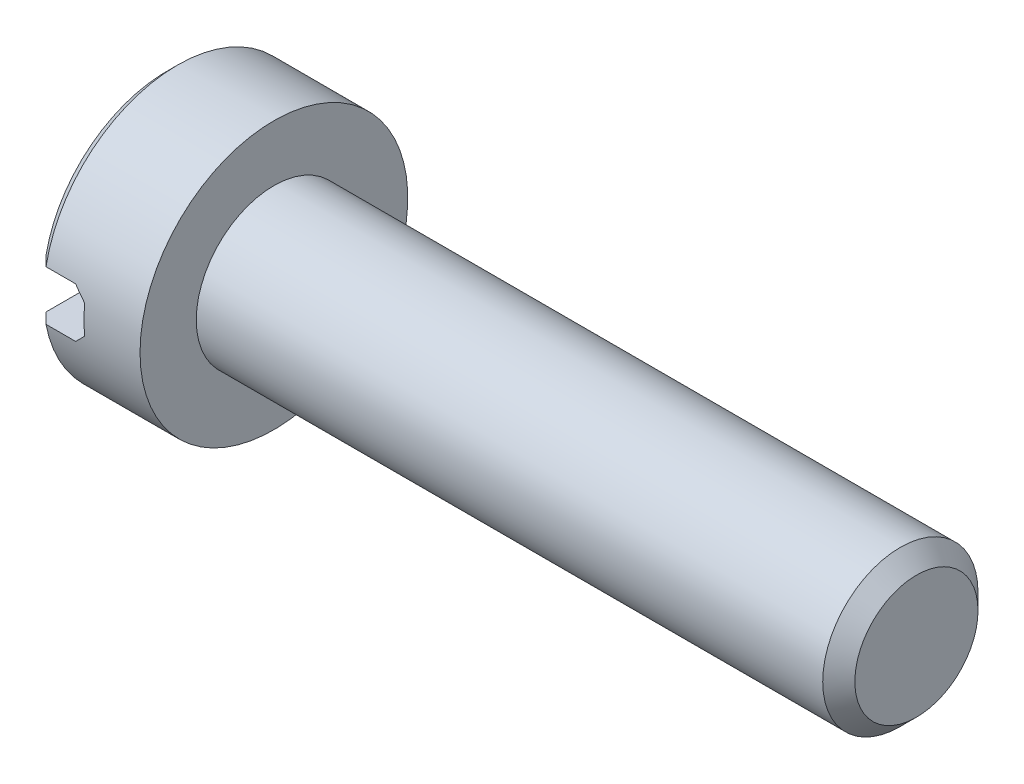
ISO-10303-21;
HEADER;
FILE_DESCRIPTION(('STEP AP214'),'2;1');
FILE_NAME('part.step','',(''),(''),'','','');
FILE_SCHEMA(('AUTOMOTIVE_DESIGN { 1 0 10303 214 1 1 1 1 }'));
ENDSEC;
DATA;
#1=APPLICATION_CONTEXT('core data for automotive mechanical design processes');
#2=APPLICATION_PROTOCOL_DEFINITION('international standard','automotive_design',2000,#1);
#3=PRODUCT_CONTEXT('',#1,'mechanical');
#4=PRODUCT('Part','Part','',(#3));
#5=PRODUCT_RELATED_PRODUCT_CATEGORY('part','',(#4));
#6=PRODUCT_DEFINITION_FORMATION('','',#4);
#7=PRODUCT_DEFINITION_CONTEXT('part definition',#1,'design');
#8=PRODUCT_DEFINITION('design','',#6,#7);
#9=PRODUCT_DEFINITION_SHAPE('','',#8);
#10=(LENGTH_UNIT() NAMED_UNIT(*) SI_UNIT(.MILLI.,.METRE.));
#11=(NAMED_UNIT(*) PLANE_ANGLE_UNIT() SI_UNIT($,.RADIAN.));
#12=(NAMED_UNIT(*) SI_UNIT($,.STERADIAN.) SOLID_ANGLE_UNIT());
#13=UNCERTAINTY_MEASURE_WITH_UNIT(LENGTH_MEASURE(1.E-05),#10,'distance_accuracy_value','');
#14=(GEOMETRIC_REPRESENTATION_CONTEXT(3) GLOBAL_UNCERTAINTY_ASSIGNED_CONTEXT((#13)) GLOBAL_UNIT_ASSIGNED_CONTEXT((#10,
#11,#12)) REPRESENTATION_CONTEXT('',''));
#15=CARTESIAN_POINT('',(0.,0.,0.));
#16=DIRECTION('',(0.,0.,1.));
#17=DIRECTION('',(1.,0.,0.));
#18=AXIS2_PLACEMENT_3D('',#15,#16,#17);
#19=CARTESIAN_POINT('',(2.,2.5,0.));
#20=DIRECTION('',(-1.,0.,0.));
#21=DIRECTION('',(0.,0.,1.));
#22=AXIS2_PLACEMENT_3D('',#19,#20,#21);
#23=PLANE('',#22);
#24=CARTESIAN_POINT('',(2.,0.,0.));
#25=DIRECTION('',(-1.,0.,0.));
#26=DIRECTION('',(0.,0.,1.));
#27=AXIS2_PLACEMENT_3D('',#24,#25,#26);
#28=CIRCLE('',#27,2.5);
#29=CARTESIAN_POINT('',(2.,0.,2.5));
#30=VERTEX_POINT('',#29);
#31=EDGE_CURVE('E198',#30,#30,#28,.T.);
#32=ORIENTED_EDGE('',*,*,#31,.F.);
#33=EDGE_LOOP('',(#32));
#34=FACE_BOUND('',#33,.T.);
#35=CARTESIAN_POINT('',(2.,0.,0.));
#36=DIRECTION('',(-1.,0.,0.));
#37=DIRECTION('',(0.,0.,1.));
#38=AXIS2_PLACEMENT_3D('',#35,#36,#37);
#39=CIRCLE('',#38,1.45);
#40=CARTESIAN_POINT('',(2.,0.,1.45));
#41=VERTEX_POINT('',#40);
#42=EDGE_CURVE('E150',#41,#41,#39,.F.);
#43=ORIENTED_EDGE('',*,*,#42,.F.);
#44=EDGE_LOOP('',(#43));
#45=FACE_BOUND('',#44,.T.);
#46=ADVANCED_FACE('F37',(#34,#45),#23,.F.);
#47=CARTESIAN_POINT('',(0.,0.,0.));
#48=DIRECTION('',(1.,0.,0.));
#49=DIRECTION('',(0.,0.,-1.));
#50=AXIS2_PLACEMENT_3D('',#47,#48,#49);
#51=PLANE('',#50);
#52=CARTESIAN_POINT('',(0.,0.,0.));
#53=DIRECTION('',(-1.,0.,0.));
#54=DIRECTION('',(0.,0.,1.));
#55=AXIS2_PLACEMENT_3D('',#52,#53,#54);
#56=CIRCLE('',#55,2.3);
#57=CARTESIAN_POINT('',(0.,0.465549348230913,2.25239068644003));
#58=VERTEX_POINT('',#57);
#59=CARTESIAN_POINT('',(0.,0.465549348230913,-2.25239068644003));
#60=VERTEX_POINT('',#59);
#61=EDGE_CURVE('E120',#58,#60,#56,.T.);
#62=ORIENTED_EDGE('',*,*,#61,.T.);
#63=DIRECTION('',(0.,0.,1.));
#64=VECTOR('',#63,1.);
#65=CARTESIAN_POINT('',(0.,0.465549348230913,-5.));
#66=LINE('',#65,#64);
#67=EDGE_CURVE('E112',#60,#58,#66,.T.);
#68=ORIENTED_EDGE('',*,*,#67,.T.);
#69=EDGE_LOOP('',(#62,#68));
#70=FACE_BOUND('',#69,.T.);
#71=ADVANCED_FACE('F166',(#70),#51,.F.);
#72=CARTESIAN_POINT('',(0.2,0.,0.));
#73=DIRECTION('',(1.,0.,0.));
#74=DIRECTION('',(0.,0.,-1.));
#75=AXIS2_PLACEMENT_3D('',#72,#73,#74);
#76=CONICAL_SURFACE('',#75,2.5,0.785398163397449);
#77=CARTESIAN_POINT('',(0.2,0.,0.));
#78=DIRECTION('',(-1.,0.,0.));
#79=DIRECTION('',(0.,0.,1.));
#80=AXIS2_PLACEMENT_3D('',#77,#78,#79);
#81=CIRCLE('',#80,2.5);
#82=CARTESIAN_POINT('',(0.2,0.465549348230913,2.45627030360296));
#83=VERTEX_POINT('',#82);
#84=CARTESIAN_POINT('',(0.2,0.465549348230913,-2.45627030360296));
#85=VERTEX_POINT('',#84);
#86=EDGE_CURVE('E121',#83,#85,#81,.T.);
#87=ORIENTED_EDGE('',*,*,#86,.T.);
#88=CARTESIAN_POINT('',(3.20259904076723,0.465549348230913,-5.48286968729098));
#89=CARTESIAN_POINT('',(3.00738145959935,0.465549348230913,-5.28694329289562));
#90=CARTESIAN_POINT('',(2.81219546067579,0.465549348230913,-5.09098538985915));
#91=CARTESIAN_POINT('',(2.42191937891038,0.465549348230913,-4.69895178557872));
#92=CARTESIAN_POINT('',(2.22682930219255,0.465549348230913,-4.50287607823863));
#93=CARTESIAN_POINT('',(1.83653240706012,0.465549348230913,-4.11030517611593));
#94=CARTESIAN_POINT('',(1.64132579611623,0.465549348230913,-3.9138097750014));
#95=CARTESIAN_POINT('',(1.25115924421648,0.465549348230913,-3.52059587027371));
#96=CARTESIAN_POINT('',(1.05619929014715,0.465549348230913,-3.32387737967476));
#97=CARTESIAN_POINT('',(0.678173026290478,0.465549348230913,-2.9416895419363));
#98=CARTESIAN_POINT('',(0.495084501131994,0.465549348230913,-2.7562421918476));
#99=CARTESIAN_POINT('',(0.220902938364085,0.465549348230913,-2.47759625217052));
#100=CARTESIAN_POINT('',(0.129576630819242,0.465549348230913,-2.38462728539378));
#101=CARTESIAN_POINT('',(-0.0528521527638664,0.465549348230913,-2.19847287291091));
#102=CARTESIAN_POINT('',(-0.143954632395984,0.465549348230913,-2.10528743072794));
#103=CARTESIAN_POINT('',(-0.325762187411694,0.465549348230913,-1.91867757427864));
#104=CARTESIAN_POINT('',(-0.416467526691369,0.465549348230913,-1.82525341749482));
#105=CARTESIAN_POINT('',(-0.597381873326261,0.465549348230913,-1.63791440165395));
#106=CARTESIAN_POINT('',(-0.687590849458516,0.465549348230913,-1.54399951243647));
#107=CARTESIAN_POINT('',(-0.867162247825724,0.465549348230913,-1.3554114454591));
#108=CARTESIAN_POINT('',(-0.956524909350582,0.465549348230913,-1.26073849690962));
#109=CARTESIAN_POINT('',(-1.08939468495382,0.465549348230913,-1.11764625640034));
#110=CARTESIAN_POINT('',(-1.1334867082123,0.465549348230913,-1.06977082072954));
#111=CARTESIAN_POINT('',(-1.2210969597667,0.465549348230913,-0.973498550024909));
#112=CARTESIAN_POINT('',(-1.26461520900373,0.465549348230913,-0.925101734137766));
#113=CARTESIAN_POINT('',(-1.3317610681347,0.465549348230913,-0.849065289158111));
#114=CARTESIAN_POINT('',(-1.35569012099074,0.465549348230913,-0.821692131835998));
#115=CARTESIAN_POINT('',(-1.40319102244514,0.465549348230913,-0.766632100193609));
#116=CARTESIAN_POINT('',(-1.42676283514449,0.465549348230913,-0.73894519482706));
#117=CARTESIAN_POINT('',(-1.47366376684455,0.465549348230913,-0.682886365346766));
#118=CARTESIAN_POINT('',(-1.49698800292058,0.465549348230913,-0.654510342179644));
#119=CARTESIAN_POINT('',(-1.54295549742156,0.465549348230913,-0.597221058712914));
#120=CARTESIAN_POINT('',(-1.56559892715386,0.465549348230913,-0.568307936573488));
#121=CARTESIAN_POINT('',(-1.61016736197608,0.465549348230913,-0.509419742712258));
#122=CARTESIAN_POINT('',(-1.63208156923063,0.465549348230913,-0.479436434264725));
#123=CARTESIAN_POINT('',(-1.67445976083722,0.465549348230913,-0.418389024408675));
#124=CARTESIAN_POINT('',(-1.69492180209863,0.465549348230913,-0.387323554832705));
#125=CARTESIAN_POINT('',(-1.73332185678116,0.465549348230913,-0.324061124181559));
#126=CARTESIAN_POINT('',(-1.75128287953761,0.465549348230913,-0.291878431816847));
#127=CARTESIAN_POINT('',(-1.78342369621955,0.465549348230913,-0.225717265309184));
#128=CARTESIAN_POINT('',(-1.79761500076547,0.465549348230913,-0.191744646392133));
#129=CARTESIAN_POINT('',(-1.81895609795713,0.465549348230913,-0.124795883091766));
#130=CARTESIAN_POINT('',(-1.8266128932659,0.465549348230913,-0.0919921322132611));
#131=CARTESIAN_POINT('',(-1.83488894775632,0.465549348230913,-0.0256267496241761));
#132=CARTESIAN_POINT('',(-1.83554895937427,0.465549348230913,0.00792935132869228));
#133=CARTESIAN_POINT('',(-1.82973306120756,0.465549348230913,0.0742464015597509));
#134=CARTESIAN_POINT('',(-1.82328333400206,0.465549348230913,0.107009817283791));
#135=CARTESIAN_POINT('',(-1.80956338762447,0.465549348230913,0.155027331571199));
#136=CARTESIAN_POINT('',(-1.80428518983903,0.465549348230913,0.170909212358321));
#137=CARTESIAN_POINT('',(-1.79261948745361,0.465549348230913,0.202260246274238));
#138=CARTESIAN_POINT('',(-1.78623214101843,0.465549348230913,0.217729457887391));
#139=CARTESIAN_POINT('',(-1.76761840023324,0.465549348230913,0.259328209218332));
#140=CARTESIAN_POINT('',(-1.7545143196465,0.465549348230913,0.285061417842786));
#141=CARTESIAN_POINT('',(-1.72651469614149,0.465549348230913,0.335544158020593));
#142=CARTESIAN_POINT('',(-1.71161720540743,0.465549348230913,0.360292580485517));
#143=CARTESIAN_POINT('',(-1.68054228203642,0.465549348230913,0.409079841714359));
#144=CARTESIAN_POINT('',(-1.66436078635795,0.465549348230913,0.433116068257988));
#145=CARTESIAN_POINT('',(-1.63111775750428,0.465549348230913,0.480575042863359));
#146=CARTESIAN_POINT('',(-1.61405601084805,0.465549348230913,0.503997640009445));
#147=CARTESIAN_POINT('',(-1.5616167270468,0.465549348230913,0.573971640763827));
#148=CARTESIAN_POINT('',(-1.52527399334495,0.465549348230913,0.619796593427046));
#149=CARTESIAN_POINT('',(-1.45124163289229,0.465549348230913,0.710149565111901));
#150=CARTESIAN_POINT('',(-1.41355526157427,0.465549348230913,0.7546802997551));
#151=CARTESIAN_POINT('',(-1.33810033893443,0.465549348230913,0.842013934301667));
#152=CARTESIAN_POINT('',(-1.30035092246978,0.465549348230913,0.88483340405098));
#153=CARTESIAN_POINT('',(-1.22427339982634,0.465549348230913,0.969954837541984));
#154=CARTESIAN_POINT('',(-1.18594527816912,0.465549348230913,1.01225678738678));
#155=CARTESIAN_POINT('',(-1.07035214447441,0.465549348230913,1.13862723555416));
#156=CARTESIAN_POINT('',(-0.992489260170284,0.465549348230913,1.22214795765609));
#157=CARTESIAN_POINT('',(-0.835814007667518,0.465549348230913,1.38847609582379));
#158=CARTESIAN_POINT('',(-0.757000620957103,0.465549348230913,1.47128254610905));
#159=CARTESIAN_POINT('',(-0.598849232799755,0.465549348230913,1.63637982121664));
#160=CARTESIAN_POINT('',(-0.519511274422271,0.465549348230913,1.71867068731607));
#161=CARTESIAN_POINT('',(-0.361217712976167,0.465549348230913,1.88216701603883));
#162=CARTESIAN_POINT('',(-0.282265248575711,0.465549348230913,1.9633755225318));
#163=CARTESIAN_POINT('',(-0.124123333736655,0.465549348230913,2.12556467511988));
#164=CARTESIAN_POINT('',(-0.044933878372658,0.465549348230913,2.20654531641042));
#165=CARTESIAN_POINT('',(0.192811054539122,0.465549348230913,2.44916767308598));
#166=CARTESIAN_POINT('',(0.351615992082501,0.465549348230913,2.61056482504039));
#167=CARTESIAN_POINT('',(0.732972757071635,0.465549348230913,2.99726131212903));
#168=CARTESIAN_POINT('',(0.955700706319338,0.465549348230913,3.22238674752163));
#169=CARTESIAN_POINT('',(1.401572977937,0.465549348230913,3.67230050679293));
#170=CARTESIAN_POINT('',(1.62471736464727,0.465549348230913,3.89708876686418));
#171=CARTESIAN_POINT('',(2.07358635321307,0.465549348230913,4.34881324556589));
#172=CARTESIAN_POINT('',(2.29931333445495,0.465549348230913,4.57574709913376));
#173=CARTESIAN_POINT('',(2.7508805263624,0.465549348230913,5.02942321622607));
#174=CARTESIAN_POINT('',(2.97672071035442,0.465549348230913,5.2561655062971));
#175=CARTESIAN_POINT('',(3.20259904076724,0.465549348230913,5.48286968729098));
#176=B_SPLINE_CURVE_WITH_KNOTS('',3,(#88,#89,#90,#91,#92,#93,#94,#95,#96,#97,#98,#99,#100,#101,
#102,#103,#104,#105,#106,#107,#108,#109,#110,#111,#112,#113,#114,#115,#116,#117,#118,#119,#120,
#121,#122,#123,#124,#125,#126,#127,#128,#129,#130,#131,#132,#133,#134,#135,#136,#137,#138,#139,
#140,#141,#142,#143,#144,#145,#146,#147,#148,#149,#150,#151,#152,#153,#154,#155,#156,#157,#158,
#159,#160,#161,#162,#163,#164,#165,#166,#167,#168,#169,#170,#171,#172,#173,#174,#175),
.UNSPECIFIED.,.F.,.F.,(4,2,2,2,2,2,2,2,2,2,2,2,2,2,2,2,2,2,2,2,2,2,2,2,2,2,2,2,2,2,2,2,2,2,2,2,
2,2,2,2,2,2,2,4),(0.,0.829743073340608,1.65953360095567,2.49046340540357,3.3213470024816,
4.10314469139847,4.49410926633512,4.88506752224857,5.27570632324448,5.66636942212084,
6.05691855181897,6.25217337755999,6.44742105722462,6.55649218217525,6.66557419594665,
6.77576205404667,6.88592195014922,6.99730763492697,7.10883965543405,7.21926609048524,
7.32935136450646,7.42981570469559,7.52969457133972,7.62920684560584,7.67938417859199,
7.72955436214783,7.81607261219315,7.90268569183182,7.9895847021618,8.07650488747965,
8.25190336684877,8.42690244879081,8.59814445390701,8.76939104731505,9.11193368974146,
9.45488345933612,9.79780541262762,10.1375912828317,10.4773842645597,11.1566564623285,
12.1067097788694,13.0569245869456,14.0171665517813,14.9772407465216),.UNSPECIFIED.);
#177=EDGE_CURVE('E60',#85,#60,#176,.T.);
#178=ORIENTED_EDGE('',*,*,#177,.T.);
#179=ORIENTED_EDGE('',*,*,#61,.F.);
#180=EDGE_CURVE('E192',#58,#83,#176,.T.);
#181=ORIENTED_EDGE('',*,*,#180,.T.);
#182=EDGE_LOOP('',(#87,#178,#179,#181));
#183=FACE_BOUND('',#182,.T.);
#184=ADVANCED_FACE('F172',(#183),#76,.T.);
#185=CARTESIAN_POINT('',(0.,-0.465549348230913,-2.25239068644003));
#186=VERTEX_POINT('',#185);
#187=CARTESIAN_POINT('',(0.,-0.465549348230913,2.25239068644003));
#188=VERTEX_POINT('',#187);
#189=EDGE_CURVE('E117',#186,#188,#56,.T.);
#190=ORIENTED_EDGE('',*,*,#189,.T.);
#191=DIRECTION('',(0.,0.,1.));
#192=VECTOR('',#191,1.);
#193=CARTESIAN_POINT('',(0.,-0.465549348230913,-5.));
#194=LINE('',#193,#192);
#195=EDGE_CURVE('E103',#186,#188,#194,.T.);
#196=ORIENTED_EDGE('',*,*,#195,.F.);
#197=EDGE_LOOP('',(#190,#196));
#198=FACE_BOUND('',#197,.T.);
#199=ADVANCED_FACE('F116',(#198),#51,.F.);
#200=CARTESIAN_POINT('',(0.2,-0.465549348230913,-2.45627030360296));
#201=VERTEX_POINT('',#200);
#202=CARTESIAN_POINT('',(0.2,-0.465549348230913,2.45627030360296));
#203=VERTEX_POINT('',#202);
#204=EDGE_CURVE('E125',#201,#203,#81,.T.);
#205=ORIENTED_EDGE('',*,*,#204,.T.);
#206=CARTESIAN_POINT('',(3.20259904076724,-0.465549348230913,5.48286968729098));
#207=CARTESIAN_POINT('',(3.00738145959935,-0.465549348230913,5.28694329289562));
#208=CARTESIAN_POINT('',(2.81219546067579,-0.465549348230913,5.09098538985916));
#209=CARTESIAN_POINT('',(2.42191937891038,-0.465549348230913,4.69895178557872));
#210=CARTESIAN_POINT('',(2.22682930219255,-0.465549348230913,4.50287607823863));
#211=CARTESIAN_POINT('',(1.83653240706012,-0.465549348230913,4.11030517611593));
#212=CARTESIAN_POINT('',(1.64132579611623,-0.465549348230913,3.9138097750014));
#213=CARTESIAN_POINT('',(1.25115924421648,-0.465549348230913,3.52059587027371));
#214=CARTESIAN_POINT('',(1.05619929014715,-0.465549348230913,3.32387737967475));
#215=CARTESIAN_POINT('',(0.678173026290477,-0.465549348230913,2.9416895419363));
#216=CARTESIAN_POINT('',(0.495084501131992,-0.465549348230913,2.75624219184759));
#217=CARTESIAN_POINT('',(0.220902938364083,-0.465549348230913,2.47759625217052));
#218=CARTESIAN_POINT('',(0.12957663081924,-0.465549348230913,2.38462728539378));
#219=CARTESIAN_POINT('',(-0.052852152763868,-0.465549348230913,2.19847287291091));
#220=CARTESIAN_POINT('',(-0.143954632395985,-0.465549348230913,2.10528743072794));
#221=CARTESIAN_POINT('',(-0.325762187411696,-0.465549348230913,1.91867757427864));
#222=CARTESIAN_POINT('',(-0.41646752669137,-0.465549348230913,1.82525341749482));
#223=CARTESIAN_POINT('',(-0.597381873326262,-0.465549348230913,1.63791440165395));
#224=CARTESIAN_POINT('',(-0.687590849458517,-0.465549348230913,1.54399951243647));
#225=CARTESIAN_POINT('',(-0.867162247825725,-0.465549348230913,1.3554114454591));
#226=CARTESIAN_POINT('',(-0.956524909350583,-0.465549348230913,1.26073849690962));
#227=CARTESIAN_POINT('',(-1.08939468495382,-0.465549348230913,1.11764625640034));
#228=CARTESIAN_POINT('',(-1.1334867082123,-0.465549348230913,1.06977082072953));
#229=CARTESIAN_POINT('',(-1.2210969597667,-0.465549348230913,0.973498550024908));
#230=CARTESIAN_POINT('',(-1.26461520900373,-0.465549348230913,0.925101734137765));
#231=CARTESIAN_POINT('',(-1.33176106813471,-0.465549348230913,0.84906528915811));
#232=CARTESIAN_POINT('',(-1.35569012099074,-0.465549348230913,0.821692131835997));
#233=CARTESIAN_POINT('',(-1.40319102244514,-0.465549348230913,0.766632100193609));
#234=CARTESIAN_POINT('',(-1.42676283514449,-0.465549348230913,0.738945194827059));
#235=CARTESIAN_POINT('',(-1.47366376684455,-0.465549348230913,0.682886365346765));
#236=CARTESIAN_POINT('',(-1.49698800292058,-0.465549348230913,0.654510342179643));
#237=CARTESIAN_POINT('',(-1.54295549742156,-0.465549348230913,0.597221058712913));
#238=CARTESIAN_POINT('',(-1.56559892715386,-0.465549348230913,0.568307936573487));
#239=CARTESIAN_POINT('',(-1.61016736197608,-0.465549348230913,0.509419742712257));
#240=CARTESIAN_POINT('',(-1.63208156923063,-0.465549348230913,0.479436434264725));
#241=CARTESIAN_POINT('',(-1.67445976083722,-0.465549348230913,0.418389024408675));
#242=CARTESIAN_POINT('',(-1.69492180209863,-0.465549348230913,0.387323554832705));
#243=CARTESIAN_POINT('',(-1.73332185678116,-0.465549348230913,0.324061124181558));
#244=CARTESIAN_POINT('',(-1.75128287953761,-0.465549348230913,0.291878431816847));
#245=CARTESIAN_POINT('',(-1.78342369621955,-0.465549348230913,0.225717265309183));
#246=CARTESIAN_POINT('',(-1.79761500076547,-0.465549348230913,0.191744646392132));
#247=CARTESIAN_POINT('',(-1.81895609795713,-0.465549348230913,0.124795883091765));
#248=CARTESIAN_POINT('',(-1.8266128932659,-0.465549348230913,0.0919921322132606));
#249=CARTESIAN_POINT('',(-1.83488894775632,-0.465549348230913,0.0256267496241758));
#250=CARTESIAN_POINT('',(-1.83554895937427,-0.465549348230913,-0.00792935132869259));
#251=CARTESIAN_POINT('',(-1.82973306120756,-0.465549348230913,-0.0742464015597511));
#252=CARTESIAN_POINT('',(-1.82328333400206,-0.465549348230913,-0.107009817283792));
#253=CARTESIAN_POINT('',(-1.80956338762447,-0.465549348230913,-0.155027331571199));
#254=CARTESIAN_POINT('',(-1.80428518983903,-0.465549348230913,-0.170909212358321));
#255=CARTESIAN_POINT('',(-1.79261948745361,-0.465549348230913,-0.202260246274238));
#256=CARTESIAN_POINT('',(-1.78623214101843,-0.465549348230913,-0.217729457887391));
#257=CARTESIAN_POINT('',(-1.76761840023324,-0.465549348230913,-0.259328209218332));
#258=CARTESIAN_POINT('',(-1.7545143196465,-0.465549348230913,-0.285061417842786));
#259=CARTESIAN_POINT('',(-1.72651469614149,-0.465549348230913,-0.335544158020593));
#260=CARTESIAN_POINT('',(-1.71161720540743,-0.465549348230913,-0.360292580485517));
#261=CARTESIAN_POINT('',(-1.68054228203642,-0.465549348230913,-0.409079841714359));
#262=CARTESIAN_POINT('',(-1.66436078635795,-0.465549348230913,-0.433116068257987));
#263=CARTESIAN_POINT('',(-1.63111775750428,-0.465549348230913,-0.480575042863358));
#264=CARTESIAN_POINT('',(-1.61405601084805,-0.465549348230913,-0.503997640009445));
#265=CARTESIAN_POINT('',(-1.5616167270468,-0.465549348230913,-0.573971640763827));
#266=CARTESIAN_POINT('',(-1.52527399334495,-0.465549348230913,-0.619796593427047));
#267=CARTESIAN_POINT('',(-1.45124163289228,-0.465549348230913,-0.710149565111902));
#268=CARTESIAN_POINT('',(-1.41355526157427,-0.465549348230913,-0.7546802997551));
#269=CARTESIAN_POINT('',(-1.33810033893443,-0.465549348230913,-0.842013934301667));
#270=CARTESIAN_POINT('',(-1.30035092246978,-0.465549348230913,-0.884833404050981));
#271=CARTESIAN_POINT('',(-1.22427339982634,-0.465549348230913,-0.969954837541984));
#272=CARTESIAN_POINT('',(-1.18594527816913,-0.465549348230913,-1.01225678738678));
#273=CARTESIAN_POINT('',(-1.07035214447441,-0.465549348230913,-1.13862723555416));
#274=CARTESIAN_POINT('',(-0.992489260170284,-0.465549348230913,-1.22214795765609));
#275=CARTESIAN_POINT('',(-0.835814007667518,-0.465549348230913,-1.38847609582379));
#276=CARTESIAN_POINT('',(-0.757000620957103,-0.465549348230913,-1.47128254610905));
#277=CARTESIAN_POINT('',(-0.598849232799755,-0.465549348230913,-1.63637982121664));
#278=CARTESIAN_POINT('',(-0.519511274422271,-0.465549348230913,-1.71867068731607));
#279=CARTESIAN_POINT('',(-0.361217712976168,-0.465549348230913,-1.88216701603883));
#280=CARTESIAN_POINT('',(-0.282265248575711,-0.465549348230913,-1.9633755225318));
#281=CARTESIAN_POINT('',(-0.124123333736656,-0.465549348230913,-2.12556467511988));
#282=CARTESIAN_POINT('',(-0.0449338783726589,-0.465549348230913,-2.20654531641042));
#283=CARTESIAN_POINT('',(0.192811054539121,-0.465549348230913,-2.44916767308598));
#284=CARTESIAN_POINT('',(0.3516159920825,-0.465549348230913,-2.61056482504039));
#285=CARTESIAN_POINT('',(0.732972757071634,-0.465549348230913,-2.99726131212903));
#286=CARTESIAN_POINT('',(0.955700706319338,-0.465549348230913,-3.22238674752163));
#287=CARTESIAN_POINT('',(1.401572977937,-0.465549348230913,-3.67230050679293));
#288=CARTESIAN_POINT('',(1.62471736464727,-0.465549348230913,-3.89708876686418));
#289=CARTESIAN_POINT('',(2.07358635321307,-0.465549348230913,-4.34881324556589));
#290=CARTESIAN_POINT('',(2.29931333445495,-0.465549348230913,-4.57574709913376));
#291=CARTESIAN_POINT('',(2.75088052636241,-0.465549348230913,-5.02942321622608));
#292=CARTESIAN_POINT('',(2.97672071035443,-0.465549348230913,-5.2561655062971));
#293=CARTESIAN_POINT('',(3.20259904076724,-0.465549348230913,-5.48286968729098));
#294=B_SPLINE_CURVE_WITH_KNOTS('',3,(#206,#207,#208,#209,#210,#211,#212,#213,#214,#215,#216,
#217,#218,#219,#220,#221,#222,#223,#224,#225,#226,#227,#228,#229,#230,#231,#232,#233,#234,#235,
#236,#237,#238,#239,#240,#241,#242,#243,#244,#245,#246,#247,#248,#249,#250,#251,#252,#253,#254,
#255,#256,#257,#258,#259,#260,#261,#262,#263,#264,#265,#266,#267,#268,#269,#270,#271,#272,#273,
#274,#275,#276,#277,#278,#279,#280,#281,#282,#283,#284,#285,#286,#287,#288,#289,#290,#291,#292,
#293),.UNSPECIFIED.,.F.,.F.,(4,2,2,2,2,2,2,2,2,2,2,2,2,2,2,2,2,2,2,2,2,2,2,2,2,2,2,2,2,2,2,2,2,
2,2,2,2,2,2,2,2,2,2,4),(0.,0.82974307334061,1.65953360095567,2.49046340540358,3.32134700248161,
4.10314469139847,4.49410926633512,4.88506752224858,5.27570632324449,5.66636942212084,
6.05691855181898,6.25217337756,6.44742105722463,6.55649218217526,6.66557419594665,
6.77576205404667,6.88592195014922,6.99730763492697,7.10883965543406,7.21926609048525,
7.32935136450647,7.42981570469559,7.52969457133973,7.62920684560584,7.67938417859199,
7.72955436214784,7.81607261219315,7.90268569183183,7.98958470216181,8.07650488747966,
8.25190336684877,8.42690244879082,8.59814445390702,8.76939104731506,9.11193368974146,
9.45488345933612,9.79780541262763,10.1375912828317,10.4773842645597,11.1566564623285,
12.1067097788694,13.0569245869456,14.0171665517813,14.9772407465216),.UNSPECIFIED.);
#295=EDGE_CURVE('E111',#203,#188,#294,.T.);
#296=ORIENTED_EDGE('',*,*,#295,.T.);
#297=ORIENTED_EDGE('',*,*,#189,.F.);
#298=EDGE_CURVE('E100',#186,#201,#294,.T.);
#299=ORIENTED_EDGE('',*,*,#298,.T.);
#300=EDGE_LOOP('',(#205,#296,#297,#299));
#301=FACE_BOUND('',#300,.T.);
#302=ADVANCED_FACE('F119',(#301),#76,.T.);
#303=CARTESIAN_POINT('',(0.,0.,0.));
#304=DIRECTION('',(-1.,0.,0.));
#305=DIRECTION('',(0.,0.,1.));
#306=AXIS2_PLACEMENT_3D('',#303,#304,#305);
#307=CYLINDRICAL_SURFACE('',#306,2.5);
#308=ORIENTED_EDGE('',*,*,#86,.F.);
#309=DIRECTION('',(-1.,0.,0.));
#310=VECTOR('',#309,1.);
#311=CARTESIAN_POINT('',(0.,0.465549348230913,2.45627030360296));
#312=LINE('',#311,#310);
#313=CARTESIAN_POINT('',(0.753445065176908,0.465549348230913,2.45627030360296));
#314=VERTEX_POINT('',#313);
#315=EDGE_CURVE('E147',#83,#314,#312,.F.);
#316=ORIENTED_EDGE('',*,*,#315,.T.);
#317=CARTESIAN_POINT('',(1.21899441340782,0.,0.));
#318=DIRECTION('',(0.707106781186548,0.707106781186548,0.));
#319=DIRECTION('',(-0.707106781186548,0.707106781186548,0.));
#320=AXIS2_PLACEMENT_3D('',#317,#318,#319);
#321=ELLIPSE('',#320,3.53553390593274,2.5);
#322=CARTESIAN_POINT('',(0.953445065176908,0.265549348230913,2.48585670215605));
#323=VERTEX_POINT('',#322);
#324=EDGE_CURVE('E142',#314,#323,#321,.T.);
#325=ORIENTED_EDGE('',*,*,#324,.T.);
#326=CARTESIAN_POINT('',(0.953445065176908,0.,0.));
#327=DIRECTION('',(1.,0.,0.));
#328=DIRECTION('',(0.,0.,-1.));
#329=AXIS2_PLACEMENT_3D('',#326,#327,#328);
#330=CIRCLE('',#329,2.5);
#331=CARTESIAN_POINT('',(0.953445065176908,-0.265549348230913,2.48585670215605));
#332=VERTEX_POINT('',#331);
#333=EDGE_CURVE('E138',#323,#332,#330,.T.);
#334=ORIENTED_EDGE('',*,*,#333,.T.);
#335=CARTESIAN_POINT('',(1.21899441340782,0.,0.));
#336=DIRECTION('',(0.707106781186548,-0.707106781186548,0.));
#337=DIRECTION('',(-0.707106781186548,-0.707106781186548,0.));
#338=AXIS2_PLACEMENT_3D('',#335,#336,#337);
#339=ELLIPSE('',#338,3.53553390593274,2.5);
#340=CARTESIAN_POINT('',(0.753445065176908,-0.465549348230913,2.45627030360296));
#341=VERTEX_POINT('',#340);
#342=EDGE_CURVE('E134',#332,#341,#339,.T.);
#343=ORIENTED_EDGE('',*,*,#342,.T.);
#344=DIRECTION('',(-1.,0.,0.));
#345=VECTOR('',#344,1.);
#346=CARTESIAN_POINT('',(0.,-0.465549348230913,2.45627030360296));
#347=LINE('',#346,#345);
#348=EDGE_CURVE('E144',#341,#203,#347,.T.);
#349=ORIENTED_EDGE('',*,*,#348,.T.);
#350=ORIENTED_EDGE('',*,*,#204,.F.);
#351=DIRECTION('',(-1.,0.,0.));
#352=VECTOR('',#351,1.);
#353=CARTESIAN_POINT('',(0.,-0.465549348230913,-2.45627030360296));
#354=LINE('',#353,#352);
#355=CARTESIAN_POINT('',(0.753445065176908,-0.465549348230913,-2.45627030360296));
#356=VERTEX_POINT('',#355);
#357=EDGE_CURVE('E106',#201,#356,#354,.F.);
#358=ORIENTED_EDGE('',*,*,#357,.T.);
#359=CARTESIAN_POINT('',(0.953445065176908,-0.265549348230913,-2.48585670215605));
#360=VERTEX_POINT('',#359);
#361=EDGE_CURVE('E130',#356,#360,#339,.T.);
#362=ORIENTED_EDGE('',*,*,#361,.T.);
#363=CARTESIAN_POINT('',(0.953445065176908,0.265549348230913,-2.48585670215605));
#364=VERTEX_POINT('',#363);
#365=EDGE_CURVE('E133',#360,#364,#330,.T.);
#366=ORIENTED_EDGE('',*,*,#365,.T.);
#367=CARTESIAN_POINT('',(0.753445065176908,0.465549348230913,-2.45627030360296));
#368=VERTEX_POINT('',#367);
#369=EDGE_CURVE('E137',#364,#368,#321,.T.);
#370=ORIENTED_EDGE('',*,*,#369,.T.);
#371=DIRECTION('',(-1.,0.,0.));
#372=VECTOR('',#371,1.);
#373=CARTESIAN_POINT('',(0.,0.465549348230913,-2.45627030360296));
#374=LINE('',#373,#372);
#375=EDGE_CURVE('E141',#368,#85,#374,.T.);
#376=ORIENTED_EDGE('',*,*,#375,.T.);
#377=EDGE_LOOP('',(#308,#316,#325,#334,#343,#349,#350,#358,#362,#366,#370,#376));
#378=FACE_BOUND('',#377,.T.);
#379=ORIENTED_EDGE('',*,*,#31,.T.);
#380=EDGE_LOOP('',(#379));
#381=FACE_BOUND('',#380,.T.);
#382=ADVANCED_FACE('F180',(#378,#381),#307,.T.);
#383=CARTESIAN_POINT('',(0.,0.465549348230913,-5.));
#384=DIRECTION('',(0.,1.,0.));
#385=DIRECTION('',(0.,0.,1.));
#386=AXIS2_PLACEMENT_3D('',#383,#384,#385);
#387=PLANE('',#386);
#388=ORIENTED_EDGE('',*,*,#375,.F.);
#389=DIRECTION('',(0.,0.,1.));
#390=VECTOR('',#389,1.);
#391=CARTESIAN_POINT('',(0.753445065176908,0.465549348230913,-5.));
#392=LINE('',#391,#390);
#393=EDGE_CURVE('E228',#368,#314,#392,.T.);
#394=ORIENTED_EDGE('',*,*,#393,.T.);
#395=ORIENTED_EDGE('',*,*,#315,.F.);
#396=ORIENTED_EDGE('',*,*,#180,.F.);
#397=ORIENTED_EDGE('',*,*,#67,.F.);
#398=ORIENTED_EDGE('',*,*,#177,.F.);
#399=EDGE_LOOP('',(#388,#394,#395,#396,#397,#398));
#400=FACE_BOUND('',#399,.T.);
#401=ADVANCED_FACE('F183',(#400),#387,.F.);
#402=CARTESIAN_POINT('',(0.753445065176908,0.465549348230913,-5.));
#403=DIRECTION('',(0.707106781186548,0.707106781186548,0.));
#404=DIRECTION('',(-0.707106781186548,0.707106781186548,0.));
#405=AXIS2_PLACEMENT_3D('',#402,#403,#404);
#406=PLANE('',#405);
#407=ORIENTED_EDGE('',*,*,#393,.F.);
#408=ORIENTED_EDGE('',*,*,#369,.F.);
#409=DIRECTION('',(0.,0.,1.));
#410=VECTOR('',#409,1.);
#411=CARTESIAN_POINT('',(0.953445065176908,0.265549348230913,-5.));
#412=LINE('',#411,#410);
#413=EDGE_CURVE('E230',#364,#323,#412,.T.);
#414=ORIENTED_EDGE('',*,*,#413,.T.);
#415=ORIENTED_EDGE('',*,*,#324,.F.);
#416=EDGE_LOOP('',(#407,#408,#414,#415));
#417=FACE_BOUND('',#416,.T.);
#418=ADVANCED_FACE('F203',(#417),#406,.F.);
#419=CARTESIAN_POINT('',(0.953445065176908,0.265549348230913,-5.));
#420=DIRECTION('',(1.,0.,0.));
#421=DIRECTION('',(0.,0.,-1.));
#422=AXIS2_PLACEMENT_3D('',#419,#420,#421);
#423=PLANE('',#422);
#424=ORIENTED_EDGE('',*,*,#413,.F.);
#425=ORIENTED_EDGE('',*,*,#365,.F.);
#426=DIRECTION('',(0.,0.,1.));
#427=VECTOR('',#426,1.);
#428=CARTESIAN_POINT('',(0.953445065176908,-0.265549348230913,-5.));
#429=LINE('',#428,#427);
#430=EDGE_CURVE('E219',#360,#332,#429,.T.);
#431=ORIENTED_EDGE('',*,*,#430,.T.);
#432=ORIENTED_EDGE('',*,*,#333,.F.);
#433=EDGE_LOOP('',(#424,#425,#431,#432));
#434=FACE_BOUND('',#433,.T.);
#435=ADVANCED_FACE('F206',(#434),#423,.F.);
#436=CARTESIAN_POINT('',(0.753445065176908,-0.465549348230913,-5.));
#437=DIRECTION('',(0.707106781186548,-0.707106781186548,0.));
#438=DIRECTION('',(0.707106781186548,0.707106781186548,0.));
#439=AXIS2_PLACEMENT_3D('',#436,#437,#438);
#440=PLANE('',#439);
#441=DIRECTION('',(0.,0.,1.));
#442=VECTOR('',#441,1.);
#443=CARTESIAN_POINT('',(0.753445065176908,-0.465549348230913,-5.));
#444=LINE('',#443,#442);
#445=EDGE_CURVE('E52',#356,#341,#444,.T.);
#446=ORIENTED_EDGE('',*,*,#445,.T.);
#447=ORIENTED_EDGE('',*,*,#342,.F.);
#448=ORIENTED_EDGE('',*,*,#430,.F.);
#449=ORIENTED_EDGE('',*,*,#361,.F.);
#450=EDGE_LOOP('',(#446,#447,#448,#449));
#451=FACE_BOUND('',#450,.T.);
#452=ADVANCED_FACE('F209',(#451),#440,.F.);
#453=CARTESIAN_POINT('',(0.,-0.465549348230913,-5.));
#454=DIRECTION('',(0.,-1.,0.));
#455=DIRECTION('',(0.,0.,-1.));
#456=AXIS2_PLACEMENT_3D('',#453,#454,#455);
#457=PLANE('',#456);
#458=ORIENTED_EDGE('',*,*,#348,.F.);
#459=ORIENTED_EDGE('',*,*,#445,.F.);
#460=ORIENTED_EDGE('',*,*,#357,.F.);
#461=ORIENTED_EDGE('',*,*,#298,.F.);
#462=ORIENTED_EDGE('',*,*,#195,.T.);
#463=ORIENTED_EDGE('',*,*,#295,.F.);
#464=EDGE_LOOP('',(#458,#459,#460,#461,#462,#463));
#465=FACE_BOUND('',#464,.T.);
#466=ADVANCED_FACE('F102',(#465),#457,.F.);
#467=CARTESIAN_POINT('',(14.,0.,0.));
#468=DIRECTION('',(-1.,0.,0.));
#469=DIRECTION('',(0.,0.,1.));
#470=AXIS2_PLACEMENT_3D('',#467,#468,#469);
#471=CYLINDRICAL_SURFACE('',#470,1.45);
#472=CARTESIAN_POINT('',(13.7,0.,0.));
#473=DIRECTION('',(1.,0.,0.));
#474=DIRECTION('',(0.,0.,-1.));
#475=AXIS2_PLACEMENT_3D('',#472,#473,#474);
#476=CIRCLE('',#475,1.45);
#477=CARTESIAN_POINT('',(13.7,0.,-1.45));
#478=VERTEX_POINT('',#477);
#479=EDGE_CURVE('E11',#478,#478,#476,.F.);
#480=ORIENTED_EDGE('',*,*,#479,.T.);
#481=EDGE_LOOP('',(#480));
#482=FACE_BOUND('',#481,.T.);
#483=ORIENTED_EDGE('',*,*,#42,.T.);
#484=EDGE_LOOP('',(#483));
#485=FACE_BOUND('',#484,.T.);
#486=ADVANCED_FACE('F162',(#482,#485),#471,.T.);
#487=CARTESIAN_POINT('',(14.,0.,0.));
#488=DIRECTION('',(1.,0.,0.));
#489=DIRECTION('',(0.,0.,-1.));
#490=AXIS2_PLACEMENT_3D('',#487,#488,#489);
#491=PLANE('',#490);
#492=CARTESIAN_POINT('',(14.,0.,0.));
#493=DIRECTION('',(1.,0.,0.));
#494=DIRECTION('',(0.,0.,-1.));
#495=AXIS2_PLACEMENT_3D('',#492,#493,#494);
#496=CIRCLE('',#495,1.15);
#497=CARTESIAN_POINT('',(14.,0.,-1.15));
#498=VERTEX_POINT('',#497);
#499=EDGE_CURVE('E45',#498,#498,#496,.T.);
#500=ORIENTED_EDGE('',*,*,#499,.T.);
#501=EDGE_LOOP('',(#500));
#502=FACE_BOUND('',#501,.T.);
#503=ADVANCED_FACE('F155',(#502),#491,.T.);
#504=CARTESIAN_POINT('',(14.,0.,0.));
#505=DIRECTION('',(-1.,0.,0.));
#506=DIRECTION('',(0.,0.,1.));
#507=AXIS2_PLACEMENT_3D('',#504,#505,#506);
#508=CONICAL_SURFACE('',#507,1.15,0.785398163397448);
#509=ORIENTED_EDGE('',*,*,#479,.F.);
#510=EDGE_LOOP('',(#509));
#511=FACE_BOUND('',#510,.T.);
#512=ORIENTED_EDGE('',*,*,#499,.F.);
#513=EDGE_LOOP('',(#512));
#514=FACE_BOUND('',#513,.T.);
#515=ADVANCED_FACE('F39',(#511,#514),#508,.T.);
#516=CLOSED_SHELL('',(#46,#71,#184,#199,#302,#382,#401,#418,#435,#452,#466,#486,#503,#515));
#517=MANIFOLD_SOLID_BREP('B2',#516);
#518=ADVANCED_BREP_SHAPE_REPRESENTATION('',(#18,#517),#14);
#519=SHAPE_DEFINITION_REPRESENTATION(#9,#518);
ENDSEC;
END-ISO-10303-21;
